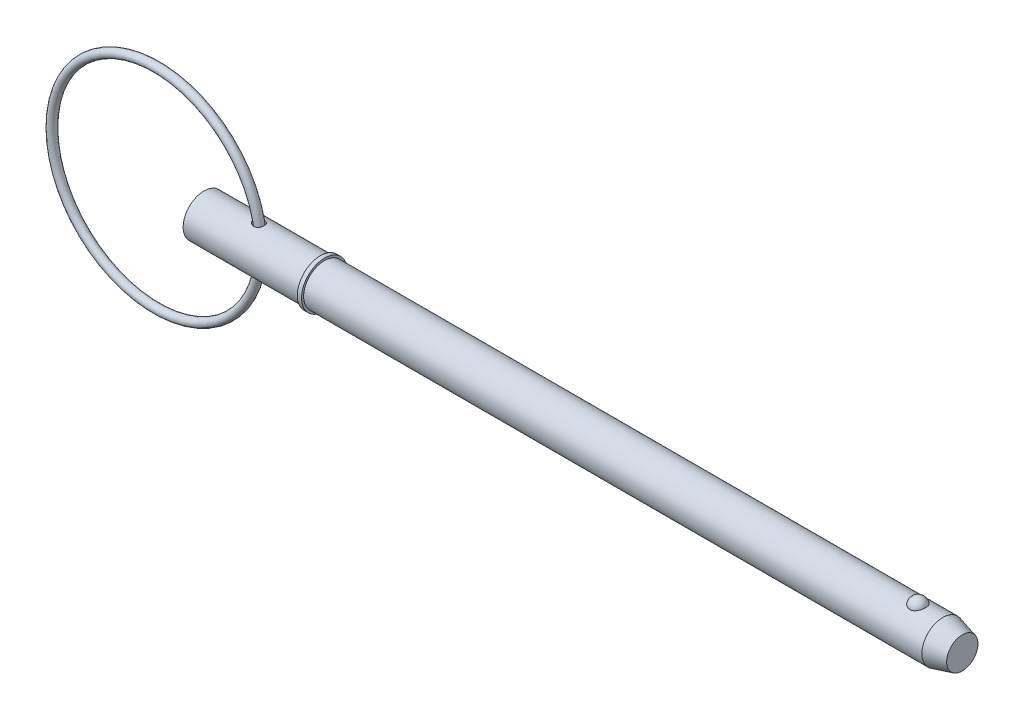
ISO-10303-21;
HEADER;
FILE_DESCRIPTION(('STEP AP214'),'2;1');
FILE_NAME('part.step','',(''),(''),'','','');
FILE_SCHEMA(('AUTOMOTIVE_DESIGN { 1 0 10303 214 1 1 1 1 }'));
ENDSEC;
DATA;
#1=APPLICATION_CONTEXT('core data for automotive mechanical design processes');
#2=APPLICATION_PROTOCOL_DEFINITION('international standard','automotive_design',2000,#1);
#3=PRODUCT_CONTEXT('',#1,'mechanical');
#4=PRODUCT('Part','Part','',(#3));
#5=PRODUCT_RELATED_PRODUCT_CATEGORY('part','',(#4));
#6=PRODUCT_DEFINITION_FORMATION('','',#4);
#7=PRODUCT_DEFINITION_CONTEXT('part definition',#1,'design');
#8=PRODUCT_DEFINITION('design','',#6,#7);
#9=PRODUCT_DEFINITION_SHAPE('','',#8);
#10=(LENGTH_UNIT() NAMED_UNIT(*) SI_UNIT(.MILLI.,.METRE.));
#11=(NAMED_UNIT(*) PLANE_ANGLE_UNIT() SI_UNIT($,.RADIAN.));
#12=(NAMED_UNIT(*) SI_UNIT($,.STERADIAN.) SOLID_ANGLE_UNIT());
#13=UNCERTAINTY_MEASURE_WITH_UNIT(LENGTH_MEASURE(1.E-05),#10,'distance_accuracy_value','');
#14=(GEOMETRIC_REPRESENTATION_CONTEXT(3) GLOBAL_UNCERTAINTY_ASSIGNED_CONTEXT((#13)) GLOBAL_UNIT_ASSIGNED_CONTEXT((#10,
#11,#12)) REPRESENTATION_CONTEXT('',''));
#15=CARTESIAN_POINT('',(0.,0.,0.));
#16=DIRECTION('',(0.,0.,1.));
#17=DIRECTION('',(1.,0.,0.));
#18=AXIS2_PLACEMENT_3D('',#15,#16,#17);
#19=CARTESIAN_POINT('',(-7.21857545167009,0.,0.));
#20=DIRECTION('',(0.,0.,1.));
#21=DIRECTION('',(1.,0.,0.));
#22=AXIS2_PLACEMENT_3D('',#19,#20,#21);
#23=TOROIDAL_SURFACE('',#22,15.875,0.634999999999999);
#24=CARTESIAN_POINT('',(9.29142454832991,0.,0.));
#25=VERTEX_POINT('',#24);
#26=VERTEX_LOOP('',#25);
#27=FACE_BOUND('',#26,.T.);
#28=ADVANCED_FACE('P0_F12',(#27),#23,.T.);
#29=CLOSED_SHELL('',(#28));
#30=MANIFOLD_SOLID_BREP('P0_B1',#29);
#31=CARTESIAN_POINT('',(0.,0.,0.));
#32=DIRECTION('',(1.,0.,0.));
#33=DIRECTION('',(0.,0.,-1.));
#34=AXIS2_PLACEMENT_3D('',#31,#32,#33);
#35=CYLINDRICAL_SURFACE('',#34,3.175);
#36=CARTESIAN_POINT('',(7.68750254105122,3.14043953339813,-0.467187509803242));
#37=CARTESIAN_POINT('',(7.71663570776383,3.13485007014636,-0.504758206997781));
#38=CARTESIAN_POINT('',(7.74907441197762,3.12895198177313,-0.539757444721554));
#39=CARTESIAN_POINT('',(7.81944011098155,3.11722901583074,-0.603799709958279));
#40=CARTESIAN_POINT('',(7.85737550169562,3.11140426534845,-0.632833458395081));
#41=CARTESIAN_POINT('',(7.93756775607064,3.10051072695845,-0.684213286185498));
#42=CARTESIAN_POINT('',(7.97981919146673,3.09544100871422,-0.706567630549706));
#43=CARTESIAN_POINT('',(8.06754397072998,3.08665483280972,-0.744015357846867));
#44=CARTESIAN_POINT('',(8.11301598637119,3.08293782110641,-0.759111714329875));
#45=CARTESIAN_POINT('',(8.20614871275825,3.07732974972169,-0.781538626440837));
#46=CARTESIAN_POINT('',(8.25381727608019,3.07544587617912,-0.788838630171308));
#47=CARTESIAN_POINT('',(8.34973955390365,3.07382984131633,-0.795114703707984));
#48=CARTESIAN_POINT('',(8.39799308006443,3.07409700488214,-0.794093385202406));
#49=CARTESIAN_POINT('',(8.4909727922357,3.07673252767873,-0.783815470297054));
#50=CARTESIAN_POINT('',(8.53575064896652,3.07898913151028,-0.774996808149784));
#51=CARTESIAN_POINT('',(8.62301664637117,3.08521060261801,-0.749844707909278));
#52=CARTESIAN_POINT('',(8.66550527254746,3.08917510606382,-0.733512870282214));
#53=CARTESIAN_POINT('',(8.74528857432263,3.09816330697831,-0.694543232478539));
#54=CARTESIAN_POINT('',(8.78272109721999,3.10313973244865,-0.672175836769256));
#55=CARTESIAN_POINT('',(8.85323831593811,3.11368155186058,-0.621513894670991));
#56=CARTESIAN_POINT('',(8.88632295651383,3.1192469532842,-0.59321927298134));
#57=CARTESIAN_POINT('',(8.94738786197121,3.13037258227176,-0.531394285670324));
#58=CARTESIAN_POINT('',(8.97535151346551,3.13593273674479,-0.497847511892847));
#59=CARTESIAN_POINT('',(9.02535984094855,3.14642822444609,-0.426512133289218));
#60=CARTESIAN_POINT('',(9.04740412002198,3.1513635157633,-0.388723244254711));
#61=CARTESIAN_POINT('',(9.08531615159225,3.16014674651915,-0.309373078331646));
#62=CARTESIAN_POINT('',(9.10109111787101,3.16397813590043,-0.267765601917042));
#63=CARTESIAN_POINT('',(9.12562372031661,3.17004373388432,-0.182419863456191));
#64=CARTESIAN_POINT('',(9.13438129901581,3.17227792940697,-0.138681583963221));
#65=CARTESIAN_POINT('',(9.14467797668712,3.17491257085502,-0.0501907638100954));
#66=CARTESIAN_POINT('',(9.14619790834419,3.17530814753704,-0.00543584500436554));
#67=CARTESIAN_POINT('',(9.14192925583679,3.17420952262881,0.0837005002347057));
#68=CARTESIAN_POINT('',(9.13614065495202,3.17271531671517,0.128081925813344));
#69=CARTESIAN_POINT('',(9.11741184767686,3.16800183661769,0.215146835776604));
#70=CARTESIAN_POINT('',(9.1044818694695,3.1647850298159,0.257832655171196));
#71=CARTESIAN_POINT('',(9.07179341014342,3.15697516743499,0.340371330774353));
#72=CARTESIAN_POINT('',(9.05203467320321,3.15238206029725,0.380224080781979));
#73=CARTESIAN_POINT('',(9.00612949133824,3.14231078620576,0.456042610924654));
#74=CARTESIAN_POINT('',(8.97997137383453,3.13683100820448,0.492001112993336));
#75=CARTESIAN_POINT('',(8.92194141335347,3.12560179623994,0.558920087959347));
#76=CARTESIAN_POINT('',(8.89006980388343,3.11985237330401,0.589880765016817));
#77=CARTESIAN_POINT('',(8.82164045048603,3.10876807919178,0.645751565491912));
#78=CARTESIAN_POINT('',(8.78510991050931,3.1034310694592,0.670694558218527));
#79=CARTESIAN_POINT('',(8.70823767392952,3.09374754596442,0.714035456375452));
#80=CARTESIAN_POINT('',(8.66789657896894,3.08940087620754,0.732434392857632));
#81=CARTESIAN_POINT('',(8.58520620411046,3.08224677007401,0.761976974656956));
#82=CARTESIAN_POINT('',(8.54289637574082,3.07941711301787,0.773225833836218));
#83=CARTESIAN_POINT('',(8.45693772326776,3.07549224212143,0.788693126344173));
#84=CARTESIAN_POINT('',(8.41328889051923,3.07439703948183,0.792911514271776));
#85=CARTESIAN_POINT('',(8.32565716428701,3.07402154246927,0.79436569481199));
#86=CARTESIAN_POINT('',(8.2816736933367,3.07475037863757,0.791566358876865));
#87=CARTESIAN_POINT('',(8.19474198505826,3.0779150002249,0.779168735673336));
#88=CARTESIAN_POINT('',(8.15179398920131,3.0803511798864,0.769568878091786));
#89=CARTESIAN_POINT('',(8.06605600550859,3.08678050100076,0.743371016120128));
#90=CARTESIAN_POINT('',(8.02336243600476,3.09083954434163,0.726473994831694));
#91=CARTESIAN_POINT('',(7.94127890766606,3.10003371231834,0.686178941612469));
#92=CARTESIAN_POINT('',(7.90189016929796,3.10516923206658,0.662778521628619));
#93=CARTESIAN_POINT('',(7.82556689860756,3.11622820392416,0.608722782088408));
#94=CARTESIAN_POINT('',(7.78884764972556,3.12217795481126,0.577767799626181));
#95=CARTESIAN_POINT('',(7.7212485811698,3.13396160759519,0.509990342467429));
#96=CARTESIAN_POINT('',(7.69036894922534,3.13979550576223,0.473167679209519));
#97=CARTESIAN_POINT('',(7.63604128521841,3.15055792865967,0.395137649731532));
#98=CARTESIAN_POINT('',(7.61248286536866,3.15549937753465,0.354009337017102));
#99=CARTESIAN_POINT('',(7.57323986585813,3.16396081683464,0.268021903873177));
#100=CARTESIAN_POINT('',(7.55754910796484,3.16748192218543,0.223165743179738));
#101=CARTESIAN_POINT('',(7.53586686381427,3.17240393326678,0.135111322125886));
#102=CARTESIAN_POINT('',(7.52916366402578,3.17395975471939,0.0920967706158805));
#103=CARTESIAN_POINT('',(7.52342449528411,3.1752897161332,0.00553088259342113));
#104=CARTESIAN_POINT('',(7.52438648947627,3.17506432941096,-0.0380203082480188));
#105=CARTESIAN_POINT('',(7.53361123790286,3.17293298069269,-0.121469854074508));
#106=CARTESIAN_POINT('',(7.54140526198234,3.17113493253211,-0.161424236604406));
#107=CARTESIAN_POINT('',(7.56329403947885,3.16619862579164,-0.239454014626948));
#108=CARTESIAN_POINT('',(7.57738500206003,3.16306117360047,-0.277530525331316));
#109=CARTESIAN_POINT('',(7.60689714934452,3.15670852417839,-0.341419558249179));
#110=CARTESIAN_POINT('',(7.62103486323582,3.15372268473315,-0.367859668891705));
#111=CARTESIAN_POINT('',(7.65218035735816,3.14734507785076,-0.418934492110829));
#112=CARTESIAN_POINT('',(7.66918829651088,3.14395328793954,-0.443569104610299));
#113=CARTESIAN_POINT('',(7.68750254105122,3.14043953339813,-0.467187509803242));
#114=B_SPLINE_CURVE_WITH_KNOTS('',3,(#36,#37,#38,#39,#40,#41,#42,#43,#44,#45,#46,#47,#48,#49,
#50,#51,#52,#53,#54,#55,#56,#57,#58,#59,#60,#61,#62,#63,#64,#65,#66,#67,#68,#69,#70,#71,#72,#73,
#74,#75,#76,#77,#78,#79,#80,#81,#82,#83,#84,#85,#86,#87,#88,#89,#90,#91,#92,#93,#94,#95,#96,#97,
#98,#99,#100,#101,#102,#103,#104,#105,#106,#107,#108,#109,#110,#111,#112,#113),.UNSPECIFIED.,
.T.,.F.,(4,2,2,2,2,2,2,2,2,2,2,2,2,2,2,2,2,2,2,2,2,2,2,2,2,2,2,2,2,2,2,2,2,2,2,2,2,2,4),(0.,
0.143496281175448,0.287214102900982,0.430753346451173,0.574233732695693,0.71827434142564,
0.862269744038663,0.998657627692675,1.13501647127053,1.26606395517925,1.39711310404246,
1.52858014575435,1.66005600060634,1.79341107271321,1.92676723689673,2.06047636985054,
2.19418580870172,2.32770423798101,2.46122766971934,2.59499649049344,2.72875984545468,
2.86177513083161,2.99476944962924,3.12575845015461,3.25674829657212,3.38839514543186,
3.5200724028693,3.65775119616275,3.79548061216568,3.93996868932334,4.08446141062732,
4.22665598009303,4.36873871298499,4.49873145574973,4.62868965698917,4.7503735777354,
4.87198434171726,4.96218670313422,5.05239406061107),.UNSPECIFIED.);
#115=CARTESIAN_POINT('',(7.68750254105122,3.14043953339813,-0.467187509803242));
#116=VERTEX_POINT('',#115);
#117=EDGE_CURVE('P1_E42',#116,#116,#114,.T.);
#118=ORIENTED_EDGE('',*,*,#117,.T.);
#119=EDGE_LOOP('',(#118));
#120=FACE_BOUND('',#119,.T.);
#121=CARTESIAN_POINT('',(0.,0.,0.));
#122=DIRECTION('',(1.,0.,0.));
#123=DIRECTION('',(0.,0.,-1.));
#124=AXIS2_PLACEMENT_3D('',#121,#122,#123);
#125=CIRCLE('',#124,3.175);
#126=CARTESIAN_POINT('',(0.,0.,-3.175));
#127=VERTEX_POINT('',#126);
#128=EDGE_CURVE('P1_E9',#127,#127,#125,.T.);
#129=ORIENTED_EDGE('',*,*,#128,.T.);
#130=EDGE_LOOP('',(#129));
#131=FACE_BOUND('',#130,.T.);
#132=CARTESIAN_POINT('',(17.655,0.,0.));
#133=DIRECTION('',(1.,0.,0.));
#134=DIRECTION('',(0.,0.,-1.));
#135=AXIS2_PLACEMENT_3D('',#132,#133,#134);
#136=CIRCLE('',#135,3.175);
#137=CARTESIAN_POINT('',(17.655,0.,-3.175));
#138=VERTEX_POINT('',#137);
#139=EDGE_CURVE('P1_E25',#138,#138,#136,.T.);
#140=ORIENTED_EDGE('',*,*,#139,.F.);
#141=EDGE_LOOP('',(#140));
#142=FACE_BOUND('',#141,.T.);
#143=CARTESIAN_POINT('',(7.68750254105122,-3.14043953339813,-0.467187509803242));
#144=CARTESIAN_POINT('',(7.66134108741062,-3.14545876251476,-0.433446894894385));
#145=CARTESIAN_POINT('',(7.63782862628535,-3.15023199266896,-0.397612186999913));
#146=CARTESIAN_POINT('',(7.59691922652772,-3.15880505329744,-0.322493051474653));
#147=CARTESIAN_POINT('',(7.57952031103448,-3.16260519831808,-0.283209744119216));
#148=CARTESIAN_POINT('',(7.55152687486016,-3.16882833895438,-0.202021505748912));
#149=CARTESIAN_POINT('',(7.54095517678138,-3.17124671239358,-0.160108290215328));
#150=CARTESIAN_POINT('',(7.52724513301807,-3.1743985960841,-0.0750206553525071));
#151=CARTESIAN_POINT('',(7.52410469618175,-3.17513258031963,-0.031846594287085));
#152=CARTESIAN_POINT('',(7.5253875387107,-3.17483506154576,0.0522260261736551));
#153=CARTESIAN_POINT('',(7.52944265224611,-3.17388949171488,0.0931310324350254));
#154=CARTESIAN_POINT('',(7.54421042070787,-3.17050389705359,0.1736507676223));
#155=CARTESIAN_POINT('',(7.5549232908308,-3.16806382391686,0.213265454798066));
#156=CARTESIAN_POINT('',(7.58252065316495,-3.16195002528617,0.290147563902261));
#157=CARTESIAN_POINT('',(7.59940259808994,-3.15827680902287,0.32741594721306));
#158=CARTESIAN_POINT('',(7.63869293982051,-3.15005936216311,0.398803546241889));
#159=CARTESIAN_POINT('',(7.66110286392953,-3.14551489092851,0.432921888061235));
#160=CARTESIAN_POINT('',(7.71258278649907,-3.13561737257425,0.49975352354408));
#161=CARTESIAN_POINT('',(7.74202268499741,-3.13022938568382,0.532176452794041));
#162=CARTESIAN_POINT('',(7.80559890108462,-3.11946135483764,0.592041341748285));
#163=CARTESIAN_POINT('',(7.83973728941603,-3.11408131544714,0.619481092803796));
#164=CARTESIAN_POINT('',(7.91474520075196,-3.10344314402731,0.670826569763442));
#165=CARTESIAN_POINT('',(7.95593439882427,-3.09822894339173,0.694276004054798));
#166=CARTESIAN_POINT('',(8.04171965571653,-3.08902387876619,0.734150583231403));
#167=CARTESIAN_POINT('',(8.08631621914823,-3.08503319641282,0.750574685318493));
#168=CARTESIAN_POINT('',(8.17840269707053,-3.07873340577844,0.776016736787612));
#169=CARTESIAN_POINT('',(8.22592511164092,-3.07644943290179,0.784924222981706));
#170=CARTESIAN_POINT('',(8.3218479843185,-3.07400734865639,0.79443684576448));
#171=CARTESIAN_POINT('',(8.37024809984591,-3.07384842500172,0.79504515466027));
#172=CARTESIAN_POINT('',(8.46394967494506,-3.07568838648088,0.787894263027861));
#173=CARTESIAN_POINT('',(8.50928504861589,-3.07757975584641,0.78055200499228));
#174=CARTESIAN_POINT('',(8.5979121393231,-3.0831587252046,0.758214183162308));
#175=CARTESIAN_POINT('',(8.6412043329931,-3.08684590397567,0.743220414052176));
#176=CARTESIAN_POINT('',(8.72259527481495,-3.09539071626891,0.706762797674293));
#177=CARTESIAN_POINT('',(8.7608371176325,-3.10019138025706,0.685603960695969));
#178=CARTESIAN_POINT('',(8.83314563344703,-3.11049979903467,0.637201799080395));
#179=CARTESIAN_POINT('',(8.86721230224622,-3.11600755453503,0.609958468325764));
#180=CARTESIAN_POINT('',(8.93027727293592,-3.12712026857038,0.550151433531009));
#181=CARTESIAN_POINT('',(8.95927559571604,-3.13272522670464,0.517587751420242));
#182=CARTESIAN_POINT('',(9.01149093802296,-3.14342495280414,0.448041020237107));
#183=CARTESIAN_POINT('',(9.03470756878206,-3.14851968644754,0.411057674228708));
#184=CARTESIAN_POINT('',(9.07510046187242,-3.15772445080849,0.333109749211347));
#185=CARTESIAN_POINT('',(9.09218248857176,-3.16181883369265,0.292094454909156));
#186=CARTESIAN_POINT('',(9.11940464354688,-3.16848144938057,0.207703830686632));
#187=CARTESIAN_POINT('',(9.12954467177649,-3.17104966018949,0.164328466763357));
#188=CARTESIAN_POINT('',(9.14265964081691,-3.17439058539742,0.0762710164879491));
#189=CARTESIAN_POINT('',(9.14560734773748,-3.17515647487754,0.0315846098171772));
#190=CARTESIAN_POINT('',(9.14418482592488,-3.1747899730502,-0.0576634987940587));
#191=CARTESIAN_POINT('',(9.13981460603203,-3.17365758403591,-0.102225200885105));
#192=CARTESIAN_POINT('',(9.12387791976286,-3.1696201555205,-0.189883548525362));
#193=CARTESIAN_POINT('',(9.11232323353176,-3.16671801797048,-0.232982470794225));
#194=CARTESIAN_POINT('',(9.08231097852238,-3.15945654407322,-0.316576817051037));
#195=CARTESIAN_POINT('',(9.06385315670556,-3.15509715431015,-0.357072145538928));
#196=CARTESIAN_POINT('',(9.02044668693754,-3.14538636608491,-0.434386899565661));
#197=CARTESIAN_POINT('',(8.99548654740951,-3.14003321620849,-0.471199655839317));
#198=CARTESIAN_POINT('',(8.93971208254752,-3.12893289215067,-0.540019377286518));
#199=CARTESIAN_POINT('',(8.9088979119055,-3.12318572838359,-0.572026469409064));
#200=CARTESIAN_POINT('',(8.84235816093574,-3.11197156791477,-0.630185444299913));
#201=CARTESIAN_POINT('',(8.80665432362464,-3.10650347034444,-0.656361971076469));
#202=CARTESIAN_POINT('',(8.73121463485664,-3.09644726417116,-0.702277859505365));
#203=CARTESIAN_POINT('',(8.69147940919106,-3.0918590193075,-0.722018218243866));
#204=CARTESIAN_POINT('',(8.60974645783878,-3.08414607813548,-0.754281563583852));
#205=CARTESIAN_POINT('',(8.56779175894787,-3.08100040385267,-0.766908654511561));
#206=CARTESIAN_POINT('',(8.48229847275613,-3.07640651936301,-0.785135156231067));
#207=CARTESIAN_POINT('',(8.4387599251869,-3.07495826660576,-0.790734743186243));
#208=CARTESIAN_POINT('',(8.35126980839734,-3.07388240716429,-0.794906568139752));
#209=CARTESIAN_POINT('',(8.30731772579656,-3.07425748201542,-0.79346845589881));
#210=CARTESIAN_POINT('',(8.22022709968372,-3.07674606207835,-0.783761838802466));
#211=CARTESIAN_POINT('',(8.17708875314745,-3.07885998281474,-0.775491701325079));
#212=CARTESIAN_POINT('',(8.09089465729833,-3.08468414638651,-0.751997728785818));
#213=CARTESIAN_POINT('',(8.0479194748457,-3.08845808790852,-0.736494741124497));
#214=CARTESIAN_POINT('',(7.96504527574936,-3.09716853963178,-0.698957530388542));
#215=CARTESIAN_POINT('',(7.92514708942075,-3.10210536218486,-0.676921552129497));
#216=CARTESIAN_POINT('',(7.8492503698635,-3.11263013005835,-0.626751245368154));
#217=CARTESIAN_POINT('',(7.81326800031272,-3.11822059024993,-0.598592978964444));
#218=CARTESIAN_POINT('',(7.74635335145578,-3.12944726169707,-0.53681285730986));
#219=CARTESIAN_POINT('',(7.71541970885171,-3.13508346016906,-0.503192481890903));
#220=CARTESIAN_POINT('',(7.68750254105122,-3.14043953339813,-0.467187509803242));
#221=B_SPLINE_CURVE_WITH_KNOTS('',3,(#143,#144,#145,#146,#147,#148,#149,#150,#151,#152,#153,
#154,#155,#156,#157,#158,#159,#160,#161,#162,#163,#164,#165,#166,#167,#168,#169,#170,#171,#172,
#173,#174,#175,#176,#177,#178,#179,#180,#181,#182,#183,#184,#185,#186,#187,#188,#189,#190,#191,
#192,#193,#194,#195,#196,#197,#198,#199,#200,#201,#202,#203,#204,#205,#206,#207,#208,#209,#210,
#211,#212,#213,#214,#215,#216,#217,#218,#219,#220),.UNSPECIFIED.,.T.,.F.,(4,2,2,2,2,2,2,2,2,2,2,
2,2,2,2,2,2,2,2,2,2,2,2,2,2,2,2,2,2,2,2,2,2,2,2,2,2,2,4),(0.,0.128825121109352,
0.257608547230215,0.386820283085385,0.515995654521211,0.638750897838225,0.761510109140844,
0.884218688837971,1.00696120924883,1.13877828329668,1.27065363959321,1.41304496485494,
1.55545741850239,1.69992800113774,1.84434335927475,1.98153642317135,2.11869732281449,
2.24997668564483,2.38125618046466,2.51253513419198,2.64382291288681,2.77704892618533,
2.91027685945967,3.04400848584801,3.17773995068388,3.31125271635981,3.44477037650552,
3.5785256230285,3.71227733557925,3.84545251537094,3.97860705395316,4.10975853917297,
4.24090673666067,4.37224786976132,4.50362039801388,4.64054596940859,4.77750836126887,
4.91501622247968,5.05248689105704),.UNSPECIFIED.);
#222=CARTESIAN_POINT('',(7.68750254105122,-3.14043953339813,-0.467187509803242));
#223=VERTEX_POINT('',#222);
#224=EDGE_CURVE('P1_E17',#223,#223,#221,.T.);
#225=ORIENTED_EDGE('',*,*,#224,.T.);
#226=EDGE_LOOP('',(#225));
#227=FACE_BOUND('',#226,.T.);
#228=ADVANCED_FACE('P1_F13',(#120,#131,#142,#227),#35,.T.);
#229=CARTESIAN_POINT('',(0.,0.,0.));
#230=DIRECTION('',(1.,0.,0.));
#231=DIRECTION('',(0.,0.,-1.));
#232=AXIS2_PLACEMENT_3D('',#229,#230,#231);
#233=CYLINDRICAL_SURFACE('',#232,3.175);
#234=CARTESIAN_POINT('',(112.147684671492,0.,0.));
#235=DIRECTION('',(1.,0.,0.));
#236=DIRECTION('',(0.,0.,-1.));
#237=AXIS2_PLACEMENT_3D('',#234,#235,#236);
#238=CIRCLE('',#237,3.175);
#239=CARTESIAN_POINT('',(112.147684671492,0.,-3.175));
#240=VERTEX_POINT('',#239);
#241=EDGE_CURVE('P1_E99',#240,#240,#238,.T.);
#242=ORIENTED_EDGE('',*,*,#241,.F.);
#243=EDGE_LOOP('',(#242));
#244=FACE_BOUND('',#243,.T.);
#245=CARTESIAN_POINT('',(18.29,0.,0.));
#246=DIRECTION('',(1.,0.,0.));
#247=DIRECTION('',(0.,0.,-1.));
#248=AXIS2_PLACEMENT_3D('',#245,#246,#247);
#249=CIRCLE('',#248,3.175);
#250=CARTESIAN_POINT('',(18.29,0.,-3.175));
#251=VERTEX_POINT('',#250);
#252=EDGE_CURVE('P1_E96',#251,#251,#249,.T.);
#253=ORIENTED_EDGE('',*,*,#252,.T.);
#254=EDGE_LOOP('',(#253));
#255=FACE_BOUND('',#254,.T.);
#256=CARTESIAN_POINT('',(108.37572762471,2.92898950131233,1.2254164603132));
#257=CARTESIAN_POINT('',(108.312316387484,2.92899434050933,1.22541146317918));
#258=CARTESIAN_POINT('',(108.248797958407,2.93112688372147,1.2203464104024));
#259=CARTESIAN_POINT('',(108.123530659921,2.93942752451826,1.20020949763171));
#260=CARTESIAN_POINT('',(108.061786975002,2.9456063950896,1.1851109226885));
#261=CARTESIAN_POINT('',(107.942065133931,2.96127115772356,1.14540352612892));
#262=CARTESIAN_POINT('',(107.884077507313,2.97074831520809,1.12081980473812));
#263=CARTESIAN_POINT('',(107.773194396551,2.99197584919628,1.06285154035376));
#264=CARTESIAN_POINT('',(107.720296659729,3.0037252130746,1.02947091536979));
#265=CARTESIAN_POINT('',(107.619268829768,3.02865714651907,0.953674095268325));
#266=CARTESIAN_POINT('',(107.571324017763,3.04187163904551,0.911021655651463));
#267=CARTESIAN_POINT('',(107.483036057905,3.06808741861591,0.818400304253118));
#268=CARTESIAN_POINT('',(107.442695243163,3.08108863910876,0.768429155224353));
#269=CARTESIAN_POINT('',(107.368803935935,3.10614903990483,0.660064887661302));
#270=CARTESIAN_POINT('',(107.335633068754,3.11814104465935,0.601396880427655));
#271=CARTESIAN_POINT('',(107.279119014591,3.13926931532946,0.479026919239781));
#272=CARTESIAN_POINT('',(107.255776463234,3.14840539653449,0.415324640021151));
#273=CARTESIAN_POINT('',(107.219178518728,3.16298160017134,0.283885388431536));
#274=CARTESIAN_POINT('',(107.206040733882,3.16837855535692,0.21611080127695));
#275=CARTESIAN_POINT('',(107.190567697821,3.17475386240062,0.0791367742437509));
#276=CARTESIAN_POINT('',(107.188232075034,3.17573236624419,0.00993738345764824));
#277=CARTESIAN_POINT('',(107.194388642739,3.17318075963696,-0.127420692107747));
#278=CARTESIAN_POINT('',(107.202807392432,3.16968122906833,-0.195583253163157));
#279=CARTESIAN_POINT('',(107.230175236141,3.1585790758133,-0.329413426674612));
#280=CARTESIAN_POINT('',(107.249124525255,3.15097637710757,-0.395080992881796));
#281=CARTESIAN_POINT('',(107.297205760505,3.13242485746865,-0.522180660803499));
#282=CARTESIAN_POINT('',(107.326352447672,3.12147119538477,-0.583606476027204));
#283=CARTESIAN_POINT('',(107.394235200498,3.09734973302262,-0.700436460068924));
#284=CARTESIAN_POINT('',(107.432972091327,3.08418174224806,-0.755840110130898));
#285=CARTESIAN_POINT('',(107.519477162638,3.05694884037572,-0.859404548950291));
#286=CARTESIAN_POINT('',(107.567296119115,3.04287919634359,-0.907521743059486));
#287=CARTESIAN_POINT('',(107.670735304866,3.01548927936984,-0.994758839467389));
#288=CARTESIAN_POINT('',(107.726354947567,3.0021689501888,-1.03387941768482));
#289=CARTESIAN_POINT('',(107.842809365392,2.97810316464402,-1.10126594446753));
#290=CARTESIAN_POINT('',(107.903518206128,2.96731170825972,-1.12973256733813));
#291=CARTESIAN_POINT('',(108.029371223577,2.94928934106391,-1.17598467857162));
#292=CARTESIAN_POINT('',(108.094513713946,2.94205708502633,-1.19377420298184));
#293=CARTESIAN_POINT('',(108.223856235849,2.93233065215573,-1.21746387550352));
#294=CARTESIAN_POINT('',(108.287938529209,2.92961621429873,-1.22391763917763));
#295=CARTESIAN_POINT('',(108.416337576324,2.92855752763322,-1.22644976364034));
#296=CARTESIAN_POINT('',(108.480654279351,2.93021238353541,-1.22253024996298));
#297=CARTESIAN_POINT('',(108.605523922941,2.9375685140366,-1.20474140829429));
#298=CARTESIAN_POINT('',(108.666131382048,2.94313790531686,-1.19119621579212));
#299=CARTESIAN_POINT('',(108.784110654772,2.95756226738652,-1.15491492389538));
#300=CARTESIAN_POINT('',(108.841482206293,2.96641750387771,-1.13217808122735));
#301=CARTESIAN_POINT('',(108.952769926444,2.98669918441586,-1.07755083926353));
#302=CARTESIAN_POINT('',(109.006584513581,2.9981771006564,-1.04547308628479));
#303=CARTESIAN_POINT('',(109.108147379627,3.02240235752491,-0.973220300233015));
#304=CARTESIAN_POINT('',(109.155894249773,3.03514999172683,-0.933043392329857));
#305=CARTESIAN_POINT('',(109.246581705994,3.06131230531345,-0.843372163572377));
#306=CARTESIAN_POINT('',(109.289158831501,3.07472822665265,-0.793510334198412));
#307=CARTESIAN_POINT('',(109.365676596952,3.10021106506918,-0.6872410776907));
#308=CARTESIAN_POINT('',(109.399615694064,3.1122777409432,-0.630832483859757));
#309=CARTESIAN_POINT('',(109.459120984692,3.134208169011,-0.51105938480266));
#310=CARTESIAN_POINT('',(109.484389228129,3.14399040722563,-0.447531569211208));
#311=CARTESIAN_POINT('',(109.524511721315,3.15983820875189,-0.31682749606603));
#312=CARTESIAN_POINT('',(109.539365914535,3.16590375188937,-0.249651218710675));
#313=CARTESIAN_POINT('',(109.558358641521,3.17370076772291,-0.113549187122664));
#314=CARTESIAN_POINT('',(109.562496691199,3.17543204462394,-0.0446233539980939));
#315=CARTESIAN_POINT('',(109.559969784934,3.17438372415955,0.0929938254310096));
#316=CARTESIAN_POINT('',(109.553305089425,3.17160423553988,0.16168517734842));
#317=CARTESIAN_POINT('',(109.529375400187,3.1618438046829,0.296502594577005));
#318=CARTESIAN_POINT('',(109.512167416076,3.15488546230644,0.362640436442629));
#319=CARTESIAN_POINT('',(109.467547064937,3.13748892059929,0.490896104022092));
#320=CARTESIAN_POINT('',(109.440133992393,3.12705048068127,0.553013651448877));
#321=CARTESIAN_POINT('',(109.375462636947,3.10369139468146,0.671876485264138));
#322=CARTESIAN_POINT('',(109.338146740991,3.0907563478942,0.728587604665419));
#323=CARTESIAN_POINT('',(109.254524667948,3.06381731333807,0.834653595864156));
#324=CARTESIAN_POINT('',(109.208218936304,3.04981337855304,0.884008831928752));
#325=CARTESIAN_POINT('',(109.107718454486,3.02230423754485,0.973916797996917));
#326=CARTESIAN_POINT('',(109.053535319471,3.00879833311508,1.01448227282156));
#327=CARTESIAN_POINT('',(108.938529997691,2.98383625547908,1.0857155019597));
#328=CARTESIAN_POINT('',(108.877705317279,2.9723808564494,1.11637952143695));
#329=CARTESIAN_POINT('',(108.753369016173,2.95329063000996,1.16592590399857));
#330=CARTESIAN_POINT('',(108.690023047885,2.9455373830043,1.18517901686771));
#331=CARTESIAN_POINT('',(108.56076644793,2.9342556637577,1.21284802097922));
#332=CARTESIAN_POINT('',(108.494864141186,2.93071450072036,1.2212964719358));
#333=CARTESIAN_POINT('',(108.411116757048,2.9291525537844,1.22502505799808));
#334=CARTESIAN_POINT('',(108.393426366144,2.92898815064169,1.22541785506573));
#335=CARTESIAN_POINT('',(108.37572762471,2.92898950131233,1.2254164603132));
#336=B_SPLINE_CURVE_WITH_KNOTS('',3,(#256,#257,#258,#259,#260,#261,#262,#263,#264,#265,#266,
#267,#268,#269,#270,#271,#272,#273,#274,#275,#276,#277,#278,#279,#280,#281,#282,#283,#284,#285,
#286,#287,#288,#289,#290,#291,#292,#293,#294,#295,#296,#297,#298,#299,#300,#301,#302,#303,#304,
#305,#306,#307,#308,#309,#310,#311,#312,#313,#314,#315,#316,#317,#318,#319,#320,#321,#322,#323,
#324,#325,#326,#327,#328,#329,#330,#331,#332,#333,#334,#335),.UNSPECIFIED.,.T.,.F.,(4,2,2,2,2,2,
2,2,2,2,2,2,2,2,2,2,2,2,2,2,2,2,2,2,2,2,2,2,2,2,2,2,2,2,2,2,2,2,2,4),(0.,0.190186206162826,
0.380880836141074,0.571074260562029,0.761183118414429,0.956866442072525,1.15260970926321,
1.3570177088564,1.56143892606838,1.76818248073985,1.97491892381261,2.18025109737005,
2.38558707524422,2.59122111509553,2.79687285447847,3.00371012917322,3.21053185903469,
3.41323429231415,3.61586005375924,3.80828192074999,4.00066436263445,4.18685798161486,
4.37306665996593,4.56330302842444,4.75358348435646,4.95345287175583,5.15335793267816,
5.35957003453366,5.56578325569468,5.7720057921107,5.97822335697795,6.18333558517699,
6.38846199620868,6.59480900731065,6.80114579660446,7.00718137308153,7.21329457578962,
7.41228022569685,7.61066481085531,7.66374777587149),.UNSPECIFIED.);
#337=CARTESIAN_POINT('',(108.37572762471,2.92898950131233,1.2254164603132));
#338=VERTEX_POINT('',#337);
#339=EDGE_CURVE('P1_E34',#338,#338,#336,.T.);
#340=ORIENTED_EDGE('',*,*,#339,.T.);
#341=EDGE_LOOP('',(#340));
#342=FACE_BOUND('',#341,.T.);
#343=ADVANCED_FACE('P1_F46',(#244,#255,#342),#233,.T.);
#344=CARTESIAN_POINT('',(0.,0.,0.));
#345=DIRECTION('',(-1.,0.,0.));
#346=DIRECTION('',(0.,0.,1.));
#347=AXIS2_PLACEMENT_3D('',#344,#345,#346);
#348=PLANE('',#347);
#349=ORIENTED_EDGE('',*,*,#128,.F.);
#350=EDGE_LOOP('',(#349));
#351=FACE_BOUND('',#350,.T.);
#352=ADVANCED_FACE('P1_F15',(#351),#348,.T.);
#353=CARTESIAN_POINT('',(17.655,3.175,0.));
#354=DIRECTION('',(-1.,0.,0.));
#355=DIRECTION('',(0.,0.,1.));
#356=AXIS2_PLACEMENT_3D('',#353,#354,#355);
#357=PLANE('',#356);
#358=ORIENTED_EDGE('',*,*,#139,.T.);
#359=EDGE_LOOP('',(#358));
#360=FACE_BOUND('',#359,.T.);
#361=CARTESIAN_POINT('',(17.655,0.,0.));
#362=DIRECTION('',(1.,0.,0.));
#363=DIRECTION('',(0.,0.,-1.));
#364=AXIS2_PLACEMENT_3D('',#361,#362,#363);
#365=CIRCLE('',#364,3.4925);
#366=CARTESIAN_POINT('',(17.655,0.,-3.4925));
#367=VERTEX_POINT('',#366);
#368=EDGE_CURVE('P1_E30',#367,#367,#365,.T.);
#369=ORIENTED_EDGE('',*,*,#368,.F.);
#370=EDGE_LOOP('',(#369));
#371=FACE_BOUND('',#370,.T.);
#372=ADVANCED_FACE('P1_F81',(#360,#371),#357,.T.);
#373=CARTESIAN_POINT('',(0.,0.,0.));
#374=DIRECTION('',(1.,0.,0.));
#375=DIRECTION('',(0.,0.,-1.));
#376=AXIS2_PLACEMENT_3D('',#373,#374,#375);
#377=CYLINDRICAL_SURFACE('',#376,3.4925);
#378=ORIENTED_EDGE('',*,*,#368,.T.);
#379=EDGE_LOOP('',(#378));
#380=FACE_BOUND('',#379,.T.);
#381=CARTESIAN_POINT('',(18.29,0.,0.));
#382=DIRECTION('',(1.,0.,0.));
#383=DIRECTION('',(0.,0.,-1.));
#384=AXIS2_PLACEMENT_3D('',#381,#382,#383);
#385=CIRCLE('',#384,3.4925);
#386=CARTESIAN_POINT('',(18.29,0.,-3.4925));
#387=VERTEX_POINT('',#386);
#388=EDGE_CURVE('P1_E95',#387,#387,#385,.T.);
#389=ORIENTED_EDGE('',*,*,#388,.F.);
#390=EDGE_LOOP('',(#389));
#391=FACE_BOUND('',#390,.T.);
#392=ADVANCED_FACE('P1_F68',(#380,#391),#377,.T.);
#393=CARTESIAN_POINT('',(18.29,3.4925,0.));
#394=DIRECTION('',(1.,0.,0.));
#395=DIRECTION('',(0.,0.,-1.));
#396=AXIS2_PLACEMENT_3D('',#393,#394,#395);
#397=PLANE('',#396);
#398=ORIENTED_EDGE('',*,*,#388,.T.);
#399=EDGE_LOOP('',(#398));
#400=FACE_BOUND('',#399,.T.);
#401=ORIENTED_EDGE('',*,*,#252,.F.);
#402=EDGE_LOOP('',(#401));
#403=FACE_BOUND('',#402,.T.);
#404=ADVANCED_FACE('P1_F62',(#400,#403),#397,.T.);
#405=CARTESIAN_POINT('',(115.11,0.,0.));
#406=DIRECTION('',(-1.,0.,0.));
#407=DIRECTION('',(0.,0.,1.));
#408=AXIS2_PLACEMENT_3D('',#405,#406,#407);
#409=CONICAL_SURFACE('',#408,2.38125000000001,0.261799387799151);
#410=ORIENTED_EDGE('',*,*,#241,.T.);
#411=EDGE_LOOP('',(#410));
#412=FACE_BOUND('',#411,.T.);
#413=CARTESIAN_POINT('',(115.11,0.,0.));
#414=DIRECTION('',(1.,0.,0.));
#415=DIRECTION('',(0.,0.,-1.));
#416=AXIS2_PLACEMENT_3D('',#413,#414,#415);
#417=CIRCLE('',#416,2.38125000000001);
#418=CARTESIAN_POINT('',(115.11,0.,-2.38125000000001));
#419=VERTEX_POINT('',#418);
#420=EDGE_CURVE('P1_E41',#419,#419,#417,.T.);
#421=ORIENTED_EDGE('',*,*,#420,.F.);
#422=EDGE_LOOP('',(#421));
#423=FACE_BOUND('',#422,.T.);
#424=ADVANCED_FACE('P1_F59',(#412,#423),#409,.T.);
#425=CARTESIAN_POINT('',(115.11,2.38125000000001,0.));
#426=DIRECTION('',(1.,0.,0.));
#427=DIRECTION('',(0.,0.,-1.));
#428=AXIS2_PLACEMENT_3D('',#425,#426,#427);
#429=PLANE('',#428);
#430=ORIENTED_EDGE('',*,*,#420,.T.);
#431=EDGE_LOOP('',(#430));
#432=FACE_BOUND('',#431,.T.);
#433=ADVANCED_FACE('P1_F55',(#432),#429,.T.);
#434=CARTESIAN_POINT('',(108.37572762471,2.8575,0.));
#435=DIRECTION('',(-1.,0.,0.));
#436=DIRECTION('',(0.,1.,0.));
#437=AXIS2_PLACEMENT_3D('',#434,#435,#436);
#438=SPHERICAL_SURFACE('',#437,1.22750000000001);
#439=ORIENTED_EDGE('',*,*,#339,.F.);
#440=EDGE_LOOP('',(#439));
#441=FACE_BOUND('',#440,.T.);
#442=ADVANCED_FACE('P1_F50',(#441),#438,.T.);
#443=CARTESIAN_POINT('',(-7.21857545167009,0.,0.));
#444=DIRECTION('',(0.,0.,1.));
#445=DIRECTION('',(1.,0.,0.));
#446=AXIS2_PLACEMENT_3D('',#443,#444,#445);
#447=TOROIDAL_SURFACE('',#446,15.875,0.793749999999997);
#448=ORIENTED_EDGE('',*,*,#224,.F.);
#449=EDGE_LOOP('',(#448));
#450=FACE_BOUND('',#449,.T.);
#451=ORIENTED_EDGE('',*,*,#117,.F.);
#452=EDGE_LOOP('',(#451));
#453=FACE_BOUND('',#452,.T.);
#454=ADVANCED_FACE('P1_F54',(#450,#453),#447,.F.);
#455=CLOSED_SHELL('',(#228,#343,#352,#372,#392,#404,#424,#433,#442,#454));
#456=MANIFOLD_SOLID_BREP('P1_B1',#455);
#457=ADVANCED_BREP_SHAPE_REPRESENTATION('',(#18,#30,#456),#14);
#458=SHAPE_DEFINITION_REPRESENTATION(#9,#457);
ENDSEC;
END-ISO-10303-21;
